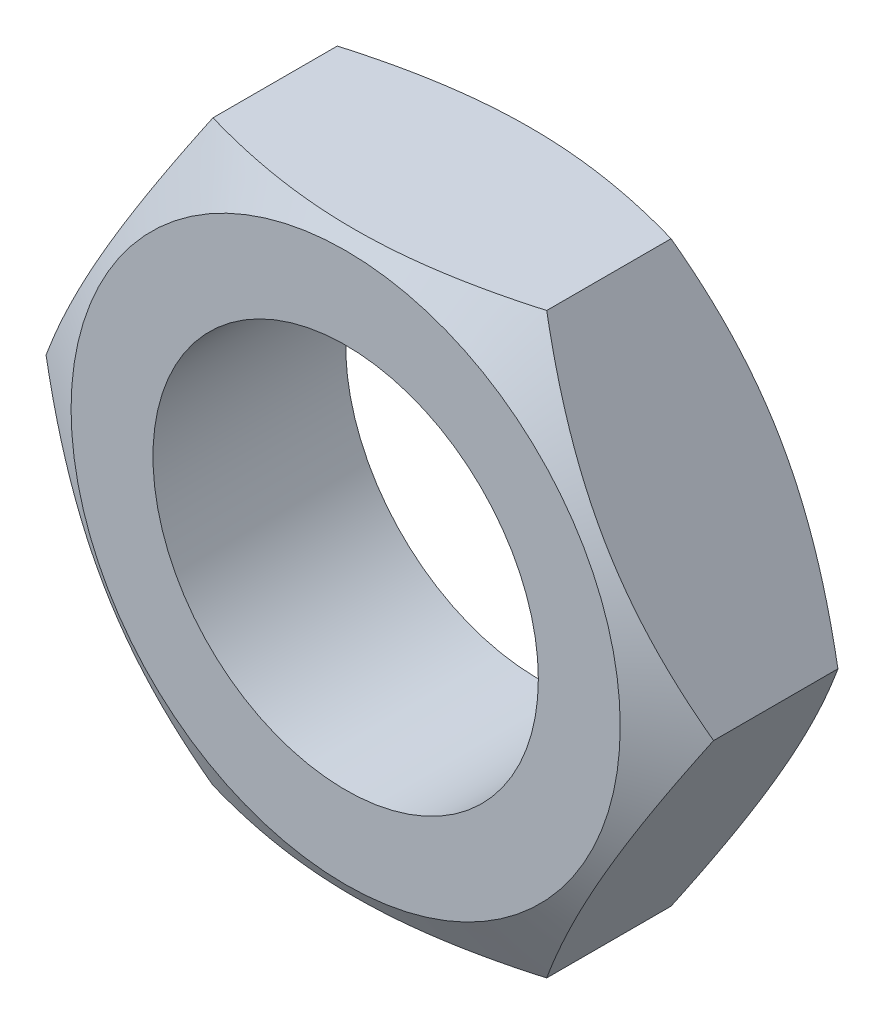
ISO-10303-21;
HEADER;
FILE_DESCRIPTION(('STEP AP214'),'2;1');
FILE_NAME('part.step','',(''),(''),'','','');
FILE_SCHEMA(('AUTOMOTIVE_DESIGN { 1 0 10303 214 1 1 1 1 }'));
ENDSEC;
DATA;
#1=APPLICATION_CONTEXT('core data for automotive mechanical design processes');
#2=APPLICATION_PROTOCOL_DEFINITION('international standard','automotive_design',2000,#1);
#3=PRODUCT_CONTEXT('',#1,'mechanical');
#4=PRODUCT('Part','Part','',(#3));
#5=PRODUCT_RELATED_PRODUCT_CATEGORY('part','',(#4));
#6=PRODUCT_DEFINITION_FORMATION('','',#4);
#7=PRODUCT_DEFINITION_CONTEXT('part definition',#1,'design');
#8=PRODUCT_DEFINITION('design','',#6,#7);
#9=PRODUCT_DEFINITION_SHAPE('','',#8);
#10=(LENGTH_UNIT() NAMED_UNIT(*) SI_UNIT(.MILLI.,.METRE.));
#11=(NAMED_UNIT(*) PLANE_ANGLE_UNIT() SI_UNIT($,.RADIAN.));
#12=(NAMED_UNIT(*) SI_UNIT($,.STERADIAN.) SOLID_ANGLE_UNIT());
#13=UNCERTAINTY_MEASURE_WITH_UNIT(LENGTH_MEASURE(1.E-05),#10,'distance_accuracy_value','');
#14=(GEOMETRIC_REPRESENTATION_CONTEXT(3) GLOBAL_UNCERTAINTY_ASSIGNED_CONTEXT((#13)) GLOBAL_UNIT_ASSIGNED_CONTEXT((#10,
#11,#12)) REPRESENTATION_CONTEXT('',''));
#15=CARTESIAN_POINT('',(0.,0.,0.));
#16=DIRECTION('',(0.,0.,1.));
#17=DIRECTION('',(1.,0.,0.));
#18=AXIS2_PLACEMENT_3D('',#15,#16,#17);
#19=CARTESIAN_POINT('',(13.856406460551,0.,-8.00000000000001));
#20=DIRECTION('',(0.866025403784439,0.5,0.));
#21=DIRECTION('',(-0.5,0.866025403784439,0.));
#22=AXIS2_PLACEMENT_3D('',#19,#20,#21);
#23=PLANE('',#22);
#24=CARTESIAN_POINT('',(13.8565219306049,-0.000200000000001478,-1.41827359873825));
#25=CARTESIAN_POINT('',(13.7042251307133,0.263585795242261,-1.33035979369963));
#26=CARTESIAN_POINT('',(13.5513604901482,0.528355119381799,-1.24643615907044));
#27=CARTESIAN_POINT('',(13.244405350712,1.06001701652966,-1.08767638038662));
#28=CARTESIAN_POINT('',(13.0903144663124,1.32691025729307,-1.01284322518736));
#29=CARTESIAN_POINT('',(12.6255589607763,2.13189040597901,-0.803427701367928));
#30=CARTESIAN_POINT('',(12.3130596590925,2.6731550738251,-0.684313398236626));
#31=CARTESIAN_POINT('',(11.8454187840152,3.483132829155,-0.544641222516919));
#32=CARTESIAN_POINT('',(11.6916742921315,3.74942610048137,-0.504853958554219));
#33=CARTESIAN_POINT('',(11.3834734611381,4.28324559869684,-0.438133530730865));
#34=CARTESIAN_POINT('',(11.2290171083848,4.55077184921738,-0.41120061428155));
#35=CARTESIAN_POINT('',(10.9198468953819,5.08627036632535,-0.3708787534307));
#36=CARTESIAN_POINT('',(10.7651335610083,5.35424172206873,-0.357473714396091));
#37=CARTESIAN_POINT('',(10.4555635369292,5.89043273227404,-0.344493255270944));
#38=CARTESIAN_POINT('',(10.3007068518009,6.15865237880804,-0.344917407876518));
#39=CARTESIAN_POINT('',(10.011202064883,6.66008937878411,-0.358630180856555));
#40=CARTESIAN_POINT('',(9.87653331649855,6.89334249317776,-0.370246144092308));
#41=CARTESIAN_POINT('',(9.60750555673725,7.35931224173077,-0.403718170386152));
#42=CARTESIAN_POINT('',(9.47314656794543,7.59202883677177,-0.425574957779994));
#43=CARTESIAN_POINT('',(9.20481134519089,8.05679907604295,-0.479147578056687));
#44=CARTESIAN_POINT('',(9.07083551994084,8.28885201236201,-0.510871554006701));
#45=CARTESIAN_POINT('',(8.80351197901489,8.75186996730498,-0.583621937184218));
#46=CARTESIAN_POINT('',(8.67016430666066,8.98283491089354,-0.624648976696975));
#47=CARTESIAN_POINT('',(8.2653799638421,9.68394195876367,-0.762721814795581));
#48=CARTESIAN_POINT('',(7.99511549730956,10.1520537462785,-0.873535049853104));
#49=CARTESIAN_POINT('',(7.45861659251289,11.0812971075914,-1.12503592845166));
#50=CARTESIAN_POINT('',(7.19237528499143,11.5424405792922,-1.26566450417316));
#51=CARTESIAN_POINT('',(6.92808776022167,12.0002,-1.41827359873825));
#52=B_SPLINE_CURVE_WITH_KNOTS('',3,(#24,#25,#26,#27,#28,#29,#30,#31,#32,#33,#34,#35,#36,#37,#38,
#39,#40,#41,#42,#43,#44,#45,#46,#47,#48,#49,#50,#51),.UNSPECIFIED.,.F.,.F.,(4,2,2,2,2,2,2,2,2,2,
2,2,2,4),(0.,0.951004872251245,1.90232158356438,3.80900466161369,4.7389455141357,
5.66890426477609,6.59775529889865,7.5265776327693,8.33514643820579,9.1437724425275,
9.95306755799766,10.7624176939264,12.4167102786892,14.0677556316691),.UNSPECIFIED.);
#53=CARTESIAN_POINT('',(13.856406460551,0.,-1.41820693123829));
#54=VERTEX_POINT('',#53);
#55=CARTESIAN_POINT('',(6.92820323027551,12.,-1.41820693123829));
#56=VERTEX_POINT('',#55);
#57=EDGE_CURVE('E67',#54,#56,#52,.T.);
#58=ORIENTED_EDGE('',*,*,#57,.F.);
#59=DIRECTION('',(0.,0.,1.));
#60=VECTOR('',#59,1.);
#61=CARTESIAN_POINT('',(13.856406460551,0.,-8.00000000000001));
#62=LINE('',#61,#60);
#63=CARTESIAN_POINT('',(13.856406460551,0.,-6.58179306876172));
#64=VERTEX_POINT('',#63);
#65=EDGE_CURVE('E14',#64,#54,#62,.T.);
#66=ORIENTED_EDGE('',*,*,#65,.F.);
#67=CARTESIAN_POINT('',(13.8565219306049,-0.000200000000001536,-6.58172640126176));
#68=CARTESIAN_POINT('',(13.7042251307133,0.263585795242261,-6.66964020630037));
#69=CARTESIAN_POINT('',(13.5513604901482,0.528355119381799,-6.75356384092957));
#70=CARTESIAN_POINT('',(13.244405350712,1.06001701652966,-6.91232361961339));
#71=CARTESIAN_POINT('',(13.0903144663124,1.32691025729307,-6.98715677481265));
#72=CARTESIAN_POINT('',(12.6255589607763,2.13189040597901,-7.19657229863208));
#73=CARTESIAN_POINT('',(12.3130596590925,2.6731550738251,-7.31568660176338));
#74=CARTESIAN_POINT('',(11.8454187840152,3.483132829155,-7.45535877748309));
#75=CARTESIAN_POINT('',(11.6916742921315,3.74942610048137,-7.49514604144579));
#76=CARTESIAN_POINT('',(11.3834734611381,4.28324559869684,-7.56186646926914));
#77=CARTESIAN_POINT('',(11.2290171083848,4.55077184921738,-7.58879938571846));
#78=CARTESIAN_POINT('',(10.9198468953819,5.08627036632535,-7.62912124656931));
#79=CARTESIAN_POINT('',(10.7651335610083,5.35424172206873,-7.64252628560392));
#80=CARTESIAN_POINT('',(10.4555635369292,5.89043273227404,-7.65550674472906));
#81=CARTESIAN_POINT('',(10.3007068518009,6.15865237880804,-7.65508259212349));
#82=CARTESIAN_POINT('',(10.011202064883,6.66008937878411,-7.64136981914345));
#83=CARTESIAN_POINT('',(9.87653331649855,6.89334249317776,-7.6297538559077));
#84=CARTESIAN_POINT('',(9.60750555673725,7.35931224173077,-7.59628182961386));
#85=CARTESIAN_POINT('',(9.47314656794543,7.59202883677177,-7.57442504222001));
#86=CARTESIAN_POINT('',(9.20481134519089,8.05679907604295,-7.52085242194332));
#87=CARTESIAN_POINT('',(9.07083551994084,8.28885201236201,-7.48912844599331));
#88=CARTESIAN_POINT('',(8.80351197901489,8.75186996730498,-7.41637806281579));
#89=CARTESIAN_POINT('',(8.67016430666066,8.98283491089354,-7.37535102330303));
#90=CARTESIAN_POINT('',(8.2653799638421,9.68394195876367,-7.23727818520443));
#91=CARTESIAN_POINT('',(7.99511549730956,10.1520537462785,-7.1264649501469));
#92=CARTESIAN_POINT('',(7.45861659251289,11.0812971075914,-6.87496407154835));
#93=CARTESIAN_POINT('',(7.19237528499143,11.5424405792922,-6.73433549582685));
#94=CARTESIAN_POINT('',(6.92808776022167,12.0002,-6.58172640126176));
#95=B_SPLINE_CURVE_WITH_KNOTS('',3,(#67,#68,#69,#70,#71,#72,#73,#74,#75,#76,#77,#78,#79,#80,#81,
#82,#83,#84,#85,#86,#87,#88,#89,#90,#91,#92,#93,#94),.UNSPECIFIED.,.F.,.F.,(4,2,2,2,2,2,2,2,2,2,
2,2,2,4),(0.,0.951004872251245,1.90232158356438,3.80900466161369,4.7389455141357,
5.66890426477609,6.59775529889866,7.5265776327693,8.33514643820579,9.1437724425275,
9.95306755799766,10.7624176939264,12.4167102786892,14.0677556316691),.UNSPECIFIED.);
#96=CARTESIAN_POINT('',(6.92820323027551,12.,-6.58179306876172));
#97=VERTEX_POINT('',#96);
#98=EDGE_CURVE('E136',#64,#97,#95,.T.);
#99=ORIENTED_EDGE('',*,*,#98,.T.);
#100=DIRECTION('',(0.,0.,1.));
#101=VECTOR('',#100,1.);
#102=CARTESIAN_POINT('',(6.92820323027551,12.,-8.00000000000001));
#103=LINE('',#102,#101);
#104=EDGE_CURVE('E54',#97,#56,#103,.T.);
#105=ORIENTED_EDGE('',*,*,#104,.T.);
#106=EDGE_LOOP('',(#58,#66,#99,#105));
#107=FACE_BOUND('',#106,.T.);
#108=ADVANCED_FACE('F50',(#107),#23,.T.);
#109=CARTESIAN_POINT('',(6.92820323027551,-12.,-8.00000000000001));
#110=DIRECTION('',(0.866025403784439,-0.5,0.));
#111=DIRECTION('',(0.5,0.866025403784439,0.));
#112=AXIS2_PLACEMENT_3D('',#109,#110,#111);
#113=PLANE('',#112);
#114=CARTESIAN_POINT('',(6.92808776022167,-12.0002,-1.41827359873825));
#115=CARTESIAN_POINT('',(7.08038456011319,-11.7364142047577,-1.33035979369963));
#116=CARTESIAN_POINT('',(7.23324920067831,-11.4716448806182,-1.24643615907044));
#117=CARTESIAN_POINT('',(7.54020434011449,-10.9399829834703,-1.08767638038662));
#118=CARTESIAN_POINT('',(7.69429522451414,-10.6730897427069,-1.01284322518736));
#119=CARTESIAN_POINT('',(8.15905073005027,-9.86810959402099,-0.803427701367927));
#120=CARTESIAN_POINT('',(8.47155003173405,-9.3268449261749,-0.684313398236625));
#121=CARTESIAN_POINT('',(8.93919090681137,-8.516867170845,-0.544641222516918));
#122=CARTESIAN_POINT('',(9.09293539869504,-8.25057389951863,-0.504853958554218));
#123=CARTESIAN_POINT('',(9.40113622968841,-7.71675440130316,-0.438133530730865));
#124=CARTESIAN_POINT('',(9.55559258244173,-7.44922815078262,-0.41120061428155));
#125=CARTESIAN_POINT('',(9.86476279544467,-6.91372963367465,-0.3708787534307));
#126=CARTESIAN_POINT('',(10.0194761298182,-6.64575827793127,-0.357473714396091));
#127=CARTESIAN_POINT('',(10.3290461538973,-6.10956726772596,-0.344493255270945));
#128=CARTESIAN_POINT('',(10.4839028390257,-5.84134762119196,-0.344917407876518));
#129=CARTESIAN_POINT('',(10.7734076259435,-5.33991062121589,-0.358630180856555));
#130=CARTESIAN_POINT('',(10.908076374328,-5.10665750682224,-0.370246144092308));
#131=CARTESIAN_POINT('',(11.1771041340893,-4.64068775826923,-0.403718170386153));
#132=CARTESIAN_POINT('',(11.3114631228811,-4.40797116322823,-0.425574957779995));
#133=CARTESIAN_POINT('',(11.5797983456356,-3.94320092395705,-0.479147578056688));
#134=CARTESIAN_POINT('',(11.7137741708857,-3.711147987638,-0.5108715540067));
#135=CARTESIAN_POINT('',(11.9810977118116,-3.24813003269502,-0.583621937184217));
#136=CARTESIAN_POINT('',(12.1144453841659,-3.01716508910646,-0.624648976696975));
#137=CARTESIAN_POINT('',(12.5192297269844,-2.31605804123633,-0.762721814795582));
#138=CARTESIAN_POINT('',(12.789494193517,-1.84794625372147,-0.873535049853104));
#139=CARTESIAN_POINT('',(13.3259930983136,-0.918702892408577,-1.12503592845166));
#140=CARTESIAN_POINT('',(13.5922344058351,-0.457559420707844,-1.26566450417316));
#141=CARTESIAN_POINT('',(13.8565219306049,0.000199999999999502,-1.41827359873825));
#142=B_SPLINE_CURVE_WITH_KNOTS('',3,(#114,#115,#116,#117,#118,#119,#120,#121,#122,#123,#124,
#125,#126,#127,#128,#129,#130,#131,#132,#133,#134,#135,#136,#137,#138,#139,#140,#141),
.UNSPECIFIED.,.F.,.F.,(4,2,2,2,2,2,2,2,2,2,2,2,2,4),(0.,0.951004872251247,1.90232158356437,
3.80900466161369,4.7389455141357,5.66890426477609,6.59775529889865,7.5265776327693,
8.33514643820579,9.14377244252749,9.95306755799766,10.7624176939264,12.4167102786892,
14.0677556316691),.UNSPECIFIED.);
#143=CARTESIAN_POINT('',(6.92820323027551,-12.,-1.41820693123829));
#144=VERTEX_POINT('',#143);
#145=EDGE_CURVE('E203',#144,#54,#142,.T.);
#146=ORIENTED_EDGE('',*,*,#145,.F.);
#147=DIRECTION('',(0.,0.,1.));
#148=VECTOR('',#147,1.);
#149=CARTESIAN_POINT('',(6.92820323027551,-12.,-8.00000000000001));
#150=LINE('',#149,#148);
#151=CARTESIAN_POINT('',(6.92820323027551,-12.,-6.58179306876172));
#152=VERTEX_POINT('',#151);
#153=EDGE_CURVE('E59',#152,#144,#150,.T.);
#154=ORIENTED_EDGE('',*,*,#153,.F.);
#155=CARTESIAN_POINT('',(6.92808776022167,-12.0002,-6.58172640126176));
#156=CARTESIAN_POINT('',(7.08038456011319,-11.7364142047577,-6.66964020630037));
#157=CARTESIAN_POINT('',(7.23324920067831,-11.4716448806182,-6.75356384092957));
#158=CARTESIAN_POINT('',(7.54020434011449,-10.9399829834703,-6.91232361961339));
#159=CARTESIAN_POINT('',(7.69429522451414,-10.6730897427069,-6.98715677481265));
#160=CARTESIAN_POINT('',(8.15905073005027,-9.86810959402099,-7.19657229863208));
#161=CARTESIAN_POINT('',(8.47155003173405,-9.3268449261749,-7.31568660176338));
#162=CARTESIAN_POINT('',(8.93919090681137,-8.516867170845,-7.45535877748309));
#163=CARTESIAN_POINT('',(9.09293539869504,-8.25057389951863,-7.49514604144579));
#164=CARTESIAN_POINT('',(9.40113622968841,-7.71675440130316,-7.56186646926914));
#165=CARTESIAN_POINT('',(9.55559258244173,-7.44922815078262,-7.58879938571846));
#166=CARTESIAN_POINT('',(9.86476279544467,-6.91372963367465,-7.62912124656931));
#167=CARTESIAN_POINT('',(10.0194761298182,-6.64575827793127,-7.64252628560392));
#168=CARTESIAN_POINT('',(10.3290461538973,-6.10956726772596,-7.65550674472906));
#169=CARTESIAN_POINT('',(10.4839028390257,-5.84134762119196,-7.65508259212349));
#170=CARTESIAN_POINT('',(10.7734076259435,-5.33991062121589,-7.64136981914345));
#171=CARTESIAN_POINT('',(10.908076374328,-5.10665750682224,-7.6297538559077));
#172=CARTESIAN_POINT('',(11.1771041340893,-4.64068775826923,-7.59628182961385));
#173=CARTESIAN_POINT('',(11.3114631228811,-4.40797116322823,-7.57442504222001));
#174=CARTESIAN_POINT('',(11.5797983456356,-3.94320092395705,-7.52085242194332));
#175=CARTESIAN_POINT('',(11.7137741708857,-3.711147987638,-7.48912844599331));
#176=CARTESIAN_POINT('',(11.9810977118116,-3.24813003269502,-7.41637806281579));
#177=CARTESIAN_POINT('',(12.1144453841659,-3.01716508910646,-7.37535102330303));
#178=CARTESIAN_POINT('',(12.5192297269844,-2.31605804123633,-7.23727818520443));
#179=CARTESIAN_POINT('',(12.789494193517,-1.84794625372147,-7.1264649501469));
#180=CARTESIAN_POINT('',(13.3259930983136,-0.918702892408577,-6.87496407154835));
#181=CARTESIAN_POINT('',(13.5922344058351,-0.457559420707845,-6.73433549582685));
#182=CARTESIAN_POINT('',(13.8565219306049,0.000199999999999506,-6.58172640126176));
#183=B_SPLINE_CURVE_WITH_KNOTS('',3,(#155,#156,#157,#158,#159,#160,#161,#162,#163,#164,#165,
#166,#167,#168,#169,#170,#171,#172,#173,#174,#175,#176,#177,#178,#179,#180,#181,#182),
.UNSPECIFIED.,.F.,.F.,(4,2,2,2,2,2,2,2,2,2,2,2,2,4),(0.,0.951004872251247,1.90232158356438,
3.80900466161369,4.7389455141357,5.66890426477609,6.59775529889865,7.5265776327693,
8.33514643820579,9.14377244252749,9.95306755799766,10.7624176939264,12.4167102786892,
14.0677556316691),.UNSPECIFIED.);
#184=EDGE_CURVE('E145',#152,#64,#183,.T.);
#185=ORIENTED_EDGE('',*,*,#184,.T.);
#186=ORIENTED_EDGE('',*,*,#65,.T.);
#187=EDGE_LOOP('',(#146,#154,#185,#186));
#188=FACE_BOUND('',#187,.T.);
#189=ADVANCED_FACE('F189',(#188),#113,.T.);
#190=CARTESIAN_POINT('',(6.92820323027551,-12.,-8.00000000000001));
#191=DIRECTION('',(0.,1.,0.));
#192=DIRECTION('',(0.,0.,1.));
#193=AXIS2_PLACEMENT_3D('',#190,#191,#192);
#194=PLANE('',#193);
#195=ORIENTED_EDGE('',*,*,#153,.T.);
#196=CARTESIAN_POINT('',(-18.6621890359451,-12.,-6.22806380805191));
#197=CARTESIAN_POINT('',(-18.3998727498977,-12.,-6.10068014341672));
#198=CARTESIAN_POINT('',(-18.1372500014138,-12.,-5.97392786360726));
#199=CARTESIAN_POINT('',(-17.6113276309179,-12.,-5.72182899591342));
#200=CARTESIAN_POINT('',(-17.3480280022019,-12.,-5.59648242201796));
#201=CARTESIAN_POINT('',(-16.5569484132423,-12.,-5.22273291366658));
#202=CARTESIAN_POINT('',(-16.0280646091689,-12.,-4.97665761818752));
#203=CARTESIAN_POINT('',(-14.9639220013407,-12.,-4.49087958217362));
#204=CARTESIAN_POINT('',(-14.4286442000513,-12.,-4.25121835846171));
#205=CARTESIAN_POINT('',(-13.353848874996,-12.,-3.78163326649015));
#206=CARTESIAN_POINT('',(-12.8143315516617,-12.,-3.55170894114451));
#207=CARTESIAN_POINT('',(-11.7127768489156,-12.,-3.09698134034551));
#208=CARTESIAN_POINT('',(-11.1505727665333,-12.,-2.87257980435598));
#209=CARTESIAN_POINT('',(-10.0196031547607,-12.,-2.44063346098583));
#210=CARTESIAN_POINT('',(-9.450836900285,-12.,-2.23309053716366));
#211=CARTESIAN_POINT('',(-8.30690331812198,-12.,-1.84027333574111));
#212=CARTESIAN_POINT('',(-7.73175142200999,-12.,-1.65495447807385));
#213=CARTESIAN_POINT('',(-6.57314432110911,-12.,-1.31248582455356));
#214=CARTESIAN_POINT('',(-5.98969177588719,-12.,-1.15532721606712));
#215=CARTESIAN_POINT('',(-5.10974707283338,-12.,-0.946787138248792));
#216=CARTESIAN_POINT('',(-4.8164262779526,-12.,-0.881943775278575));
#217=CARTESIAN_POINT('',(-4.22777074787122,-12.,-0.762097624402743));
#218=CARTESIAN_POINT('',(-3.93243605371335,-12.,-0.707094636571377));
#219=CARTESIAN_POINT('',(-3.33995366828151,-12.,-0.607897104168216));
#220=CARTESIAN_POINT('',(-3.04280601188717,-12.,-0.56370235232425));
#221=CARTESIAN_POINT('',(-2.4470072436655,-12.,-0.487000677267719));
#222=CARTESIAN_POINT('',(-2.14835619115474,-12.,-0.454493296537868));
#223=CARTESIAN_POINT('',(-1.5538927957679,-12.,-0.402222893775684));
#224=CARTESIAN_POINT('',(-1.25809478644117,-12.,-0.382297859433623));
#225=CARTESIAN_POINT('',(-0.66592171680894,-12.,-0.35497736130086));
#226=CARTESIAN_POINT('',(-0.369546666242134,-12.,-0.347581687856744));
#227=CARTESIAN_POINT('',(0.223253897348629,-12.,-0.345496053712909));
#228=CARTESIAN_POINT('',(0.519679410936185,-12.,-0.350806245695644));
#229=CARTESIAN_POINT('',(1.11204134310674,-12.,-0.374002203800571));
#230=CARTESIAN_POINT('',(1.40797773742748,-12.,-0.391888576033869));
#231=CARTESIAN_POINT('',(2.1174605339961,-12.,-0.449465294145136));
#232=CARTESIAN_POINT('',(2.53054076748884,-12.,-0.495025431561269));
#233=CARTESIAN_POINT('',(3.35365157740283,-12.,-0.608176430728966));
#234=CARTESIAN_POINT('',(3.7636817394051,-12.,-0.675770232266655));
#235=CARTESIAN_POINT('',(4.98870520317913,-12.,-0.908018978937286));
#236=CARTESIAN_POINT('',(5.79819417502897,-12.,-1.10210106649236));
#237=CARTESIAN_POINT('',(7.00899483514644,-12.,-1.43894947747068));
#238=CARTESIAN_POINT('',(7.4165737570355,-12.,-1.56048477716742));
#239=CARTESIAN_POINT('',(8.22777173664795,-12.,-1.8162388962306));
#240=CARTESIAN_POINT('',(8.63139076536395,-12.,-1.95045780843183));
#241=CARTESIAN_POINT('',(9.43479944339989,-12.,-2.22942003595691));
#242=CARTESIAN_POINT('',(9.83459025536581,-12.,-2.37416003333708));
#243=CARTESIAN_POINT('',(10.6308505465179,-12.,-2.67245488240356));
#244=CARTESIAN_POINT('',(11.0273200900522,-12.,-2.82600956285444));
#245=CARTESIAN_POINT('',(12.0605293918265,-12.,-3.23727227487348));
#246=CARTESIAN_POINT('',(12.694910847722,-12.,-3.50089824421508));
#247=CARTESIAN_POINT('',(13.9574933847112,-12.,-4.04260499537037));
#248=CARTESIAN_POINT('',(14.5856938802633,-12.,-4.32068713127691));
#249=CARTESIAN_POINT('',(15.8372708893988,-12.,-4.88800709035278));
#250=CARTESIAN_POINT('',(16.4606457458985,-12.,-5.17724855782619));
#251=CARTESIAN_POINT('',(17.7033003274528,-12.,-5.76431835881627));
#252=CARTESIAN_POINT('',(18.322580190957,-12.,-6.06214640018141));
#253=CARTESIAN_POINT('',(19.5587115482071,-12.,-6.6650139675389));
#254=CARTESIAN_POINT('',(20.1755582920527,-12.,-6.97006321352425));
#255=CARTESIAN_POINT('',(21.4065334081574,-12.,-7.58559997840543));
#256=CARTESIAN_POINT('',(22.0206617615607,-12.,-7.89608753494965));
#257=CARTESIAN_POINT('',(23.2465557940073,-12.,-8.52140690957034));
#258=CARTESIAN_POINT('',(23.8583218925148,-12.,-8.83623790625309));
#259=CARTESIAN_POINT('',(25.0799779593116,-12.,-9.46951125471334));
#260=CARTESIAN_POINT('',(25.6898679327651,-12.,-9.78795359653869));
#261=CARTESIAN_POINT('',(27.3955756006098,-12.,-10.6838713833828));
#262=CARTESIAN_POINT('',(28.4896395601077,-12.,-11.2646851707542));
#263=CARTESIAN_POINT('',(30.6740549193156,-12.,-12.4333742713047));
#264=CARTESIAN_POINT('',(31.7644061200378,-12.,-13.0212499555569));
#265=CARTESIAN_POINT('',(33.9389193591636,-12.,-14.2005035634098));
#266=CARTESIAN_POINT('',(35.0230901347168,-12.,-14.7918653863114));
#267=CARTESIAN_POINT('',(36.6476384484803,-12.,-15.6819323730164));
#268=CARTESIAN_POINT('',(37.1888512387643,-12.,-15.9791150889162));
#269=CARTESIAN_POINT('',(38.2707786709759,-12.,-16.5743843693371));
#270=CARTESIAN_POINT('',(38.8114933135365,-12.,-16.8724709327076));
#271=CARTESIAN_POINT('',(39.3519888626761,-12.,-17.1709543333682));
#272=B_SPLINE_CURVE_WITH_KNOTS('',3,(#196,#197,#198,#199,#200,#201,#202,#203,#204,#205,#206,
#207,#208,#209,#210,#211,#212,#213,#214,#215,#216,#217,#218,#219,#220,#221,#222,#223,#224,#225,
#226,#227,#228,#229,#230,#231,#232,#233,#234,#235,#236,#237,#238,#239,#240,#241,#242,#243,#244,
#245,#246,#247,#248,#249,#250,#251,#252,#253,#254,#255,#256,#257,#258,#259,#260,#261,#262,#263,
#264,#265,#266,#267,#268,#269,#270,#271),.UNSPECIFIED.,.F.,.F.,(4,2,2,2,2,2,2,2,2,2,2,2,2,2,2,2,
2,2,2,2,2,2,2,2,2,2,2,2,2,2,2,2,2,2,2,2,2,4),(0.,0.874828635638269,1.74966596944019,
3.49959708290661,5.25896415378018,7.01824854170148,8.83404465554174,10.6500433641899,
12.4623361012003,14.2740606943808,15.1751302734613,16.0761815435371,16.9772155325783,
17.8782142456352,18.7673613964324,19.6564936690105,20.5456366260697,21.4348224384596,
22.6808753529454,23.9270945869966,26.4208445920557,27.6966767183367,28.9725181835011,
30.2479590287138,31.5233751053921,33.5840464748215,35.6449112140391,37.7064547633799,
39.7679282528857,41.8323550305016,43.8967961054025,45.9608519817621,48.0249021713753,
51.7408929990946,55.4570799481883,59.1619586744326,61.0142700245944,62.8665790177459),.UNSPECIFIED.);
#273=CARTESIAN_POINT('',(-6.92820323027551,-12.,-1.41820693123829));
#274=VERTEX_POINT('',#273);
#275=EDGE_CURVE('E196',#144,#274,#272,.F.);
#276=ORIENTED_EDGE('',*,*,#275,.T.);
#277=DIRECTION('',(0.,0.,1.));
#278=VECTOR('',#277,1.);
#279=CARTESIAN_POINT('',(-6.92820323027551,-12.,-8.00000000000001));
#280=LINE('',#279,#278);
#281=CARTESIAN_POINT('',(-6.92820323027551,-12.,-6.58179306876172));
#282=VERTEX_POINT('',#281);
#283=EDGE_CURVE('E125',#282,#274,#280,.T.);
#284=ORIENTED_EDGE('',*,*,#283,.F.);
#285=CARTESIAN_POINT('',(-18.6864834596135,-12.,-1.76013607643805));
#286=CARTESIAN_POINT('',(-18.4240642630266,-12.,-1.88761818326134));
#287=CARTESIAN_POINT('',(-18.1613391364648,-12.,-2.01447024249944));
#288=CARTESIAN_POINT('',(-17.6352131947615,-12.,-2.2667716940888));
#289=CARTESIAN_POINT('',(-17.3718123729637,-12.,-2.39222107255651));
#290=CARTESIAN_POINT('',(-16.5804314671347,-12.,-2.7662839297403));
#291=CARTESIAN_POINT('',(-16.0513494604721,-12.,-3.01257485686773));
#292=CARTESIAN_POINT('',(-14.9868276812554,-12.,-3.49879698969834));
#293=CARTESIAN_POINT('',(-14.451369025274,-12.,-3.73868695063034));
#294=CARTESIAN_POINT('',(-13.3762190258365,-12.,-4.20875237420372));
#295=CARTESIAN_POINT('',(-12.8365278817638,-12.,-4.43892829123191));
#296=CARTESIAN_POINT('',(-11.734533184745,-12.,-4.89423606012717));
#297=CARTESIAN_POINT('',(-11.172062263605,-12.,-5.11896491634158));
#298=CARTESIAN_POINT('',(-10.0405648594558,-12.,-5.55159956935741));
#299=CARTESIAN_POINT('',(-9.47153765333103,-12.,-5.75950348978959));
#300=CARTESIAN_POINT('',(-8.32708033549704,-12.,-6.15308459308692));
#301=CARTESIAN_POINT('',(-7.75166557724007,-12.,-6.33880606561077));
#302=CARTESIAN_POINT('',(-6.59252918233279,-12.,-6.68212515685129));
#303=CARTESIAN_POINT('',(-6.00881019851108,-12.,-6.8397315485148));
#304=CARTESIAN_POINT('',(-5.12846360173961,-12.,-7.04897140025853));
#305=CARTESIAN_POINT('',(-4.83501305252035,-12.,-7.11405129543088));
#306=CARTESIAN_POINT('',(-4.24609267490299,-12.,-7.23437952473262));
#307=CARTESIAN_POINT('',(-3.95062288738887,-12.,-7.28962805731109));
#308=CARTESIAN_POINT('',(-3.35786336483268,-12.,-7.3893228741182));
#309=CARTESIAN_POINT('',(-3.06057366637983,-12.,-7.43376937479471));
#310=CARTESIAN_POINT('',(-2.46448192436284,-12.,-7.51097668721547));
#311=CARTESIAN_POINT('',(-2.16567994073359,-12.,-7.54373795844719));
#312=CARTESIAN_POINT('',(-1.57091850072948,-12.,-7.59650867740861));
#313=CARTESIAN_POINT('',(-1.27497355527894,-12.,-7.61668066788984));
#314=CARTESIAN_POINT('',(-0.682496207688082,-12.,-7.64448736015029));
#315=CARTESIAN_POINT('',(-0.385963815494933,-12.,-7.65212227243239));
#316=CARTESIAN_POINT('',(0.207161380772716,-12.,-7.65467286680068));
#317=CARTESIAN_POINT('',(0.503754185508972,-12.,-7.64958840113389));
#318=CARTESIAN_POINT('',(1.09645941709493,-12.,-7.62682519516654));
#319=CARTESIAN_POINT('',(1.3925718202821,-12.,-7.60914585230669));
#320=CARTESIAN_POINT('',(2.10174795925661,-12.,-7.55209835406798));
#321=CARTESIAN_POINT('',(2.51435217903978,-12.,-7.50689209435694));
#322=CARTESIAN_POINT('',(3.33653036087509,-12.,-7.39447324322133));
#323=CARTESIAN_POINT('',(3.74610391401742,-12.,-7.32725773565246));
#324=CARTESIAN_POINT('',(4.96977811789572,-12.,-7.09615911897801));
#325=CARTESIAN_POINT('',(5.77839925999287,-12.,-6.90286339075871));
#326=CARTESIAN_POINT('',(6.98793437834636,-12.,-6.56717696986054));
#327=CARTESIAN_POINT('',(7.39510372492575,-12.,-6.4460264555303));
#328=CARTESIAN_POINT('',(8.20548701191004,-12.,-6.19103119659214));
#329=CARTESIAN_POINT('',(8.60870092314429,-12.,-6.05718635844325));
#330=CARTESIAN_POINT('',(9.41130283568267,-12.,-5.77895973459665));
#331=CARTESIAN_POINT('',(9.81069198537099,-12.,-5.63458123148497));
#332=CARTESIAN_POINT('',(10.6061488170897,-12.,-5.33699761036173));
#333=CARTESIAN_POINT('',(11.0022165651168,-12.,-5.18379266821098));
#334=CARTESIAN_POINT('',(12.0397464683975,-12.,-4.7712952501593));
#335=CARTESIAN_POINT('',(12.678785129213,-12.,-4.50591389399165));
#336=CARTESIAN_POINT('',(13.9505851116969,-12.,-3.96046341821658));
#337=CARTESIAN_POINT('',(14.5833458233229,-12.,-3.68039288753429));
#338=CARTESIAN_POINT('',(15.8439780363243,-12.,-3.10893693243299));
#339=CARTESIAN_POINT('',(16.4718478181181,-12.,-2.81754772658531));
#340=CARTESIAN_POINT('',(17.7234397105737,-12.,-2.22607649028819));
#341=CARTESIAN_POINT('',(18.3471619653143,-12.,-1.92599476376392));
#342=CARTESIAN_POINT('',(19.592162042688,-12.,-1.31853592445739));
#343=CARTESIAN_POINT('',(20.2134349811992,-12.,-1.01114882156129));
#344=CARTESIAN_POINT('',(21.4532353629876,-12.,-0.390884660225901));
#345=CARTESIAN_POINT('',(22.0717627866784,-12.,-0.0780075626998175));
#346=CARTESIAN_POINT('',(23.306431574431,-12.,0.552125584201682));
#347=CARTESIAN_POINT('',(23.9225733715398,-12.,0.869380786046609));
#348=CARTESIAN_POINT('',(25.1529661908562,-12.,1.5075286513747));
#349=CARTESIAN_POINT('',(25.7672172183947,-12.,1.82842130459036));
#350=CARTESIAN_POINT('',(27.4839862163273,-12.,2.73062987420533));
#351=CARTESIAN_POINT('',(28.5847437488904,-12.,3.31529508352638));
#352=CARTESIAN_POINT('',(30.782534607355,-12.,4.49170952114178));
#353=CARTESIAN_POINT('',(31.8795677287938,-12.,5.08345913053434));
#354=CARTESIAN_POINT('',(34.0673709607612,-12.,6.27043540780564));
#355=CARTESIAN_POINT('',(35.1581499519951,-12.,6.86564571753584));
#356=CARTESIAN_POINT('',(36.7926067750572,-12.,7.76148909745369));
#357=CARTESIAN_POINT('',(37.3371213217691,-12.,8.06059763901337));
#358=CARTESIAN_POINT('',(38.4256515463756,-12.,8.65971954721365));
#359=CARTESIAN_POINT('',(38.9696672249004,-12.,8.95973291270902));
#360=CARTESIAN_POINT('',(39.5134635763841,-12.,9.26014340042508));
#361=B_SPLINE_CURVE_WITH_KNOTS('',3,(#285,#286,#287,#288,#289,#290,#291,#292,#293,#294,#295,
#296,#297,#298,#299,#300,#301,#302,#303,#304,#305,#306,#307,#308,#309,#310,#311,#312,#313,#314,
#315,#316,#317,#318,#319,#320,#321,#322,#323,#324,#325,#326,#327,#328,#329,#330,#331,#332,#333,
#334,#335,#336,#337,#338,#339,#340,#341,#342,#343,#344,#345,#346,#347,#348,#349,#350,#351,#352,
#353,#354,#355,#356,#357,#358,#359,#360),.UNSPECIFIED.,.F.,.F.,(4,2,2,2,2,2,2,2,2,2,2,2,2,2,2,2,
2,2,2,2,2,2,2,2,2,2,2,2,2,2,2,2,2,2,2,2,2,4),(0.,0.875235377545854,1.75047941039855,
3.50122280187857,5.26136589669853,7.02142656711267,8.83833119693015,10.6554381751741,
12.468854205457,14.281703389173,15.1833067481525,16.0848919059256,16.9864589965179,
17.8879906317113,18.7776275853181,19.6672496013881,20.5568819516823,21.4465568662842,
22.6910756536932,23.9357594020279,26.4264255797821,27.7007499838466,28.9750837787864,
30.2490221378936,31.5229351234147,33.5985217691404,35.6743081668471,37.7507941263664,
39.8272075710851,41.9066456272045,43.9860984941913,46.0651543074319,48.1442042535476,
51.883349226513,55.6226962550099,59.3505076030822,61.2142822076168,63.078054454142),.UNSPECIFIED.);
#362=EDGE_CURVE('E180',#152,#282,#361,.F.);
#363=ORIENTED_EDGE('',*,*,#362,.F.);
#364=EDGE_LOOP('',(#195,#276,#284,#363));
#365=FACE_BOUND('',#364,.T.);
#366=ADVANCED_FACE('F185',(#365),#194,.F.);
#367=CARTESIAN_POINT('',(-13.856406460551,0.,-8.00000000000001));
#368=DIRECTION('',(-0.866025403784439,-0.5,0.));
#369=DIRECTION('',(0.5,-0.866025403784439,0.));
#370=AXIS2_PLACEMENT_3D('',#367,#368,#369);
#371=PLANE('',#370);
#372=CARTESIAN_POINT('',(-13.8565219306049,0.000199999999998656,-1.41827359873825));
#373=CARTESIAN_POINT('',(-13.7042251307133,-0.263585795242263,-1.33035979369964));
#374=CARTESIAN_POINT('',(-13.5513604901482,-0.528355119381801,-1.24643615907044));
#375=CARTESIAN_POINT('',(-13.244405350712,-1.06001701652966,-1.08767638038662));
#376=CARTESIAN_POINT('',(-13.0903144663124,-1.32691025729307,-1.01284322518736));
#377=CARTESIAN_POINT('',(-12.6255589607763,-2.13189040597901,-0.803427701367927));
#378=CARTESIAN_POINT('',(-12.3130596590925,-2.6731550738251,-0.684313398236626));
#379=CARTESIAN_POINT('',(-11.8454187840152,-3.483132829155,-0.54464122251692));
#380=CARTESIAN_POINT('',(-11.6916742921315,-3.74942610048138,-0.50485395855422));
#381=CARTESIAN_POINT('',(-11.3834734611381,-4.28324559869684,-0.438133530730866));
#382=CARTESIAN_POINT('',(-11.2290171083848,-4.55077184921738,-0.41120061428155));
#383=CARTESIAN_POINT('',(-10.9198468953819,-5.08627036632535,-0.3708787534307));
#384=CARTESIAN_POINT('',(-10.7651335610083,-5.35424172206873,-0.357473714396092));
#385=CARTESIAN_POINT('',(-10.4555635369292,-5.89043273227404,-0.344493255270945));
#386=CARTESIAN_POINT('',(-10.3007068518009,-6.15865237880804,-0.344917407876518));
#387=CARTESIAN_POINT('',(-10.011202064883,-6.66008937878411,-0.358630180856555));
#388=CARTESIAN_POINT('',(-9.87653331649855,-6.89334249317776,-0.370246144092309));
#389=CARTESIAN_POINT('',(-9.60750555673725,-7.35931224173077,-0.403718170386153));
#390=CARTESIAN_POINT('',(-9.47314656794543,-7.59202883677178,-0.425574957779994));
#391=CARTESIAN_POINT('',(-9.2048113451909,-8.05679907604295,-0.479147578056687));
#392=CARTESIAN_POINT('',(-9.07083551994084,-8.28885201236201,-0.510871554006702));
#393=CARTESIAN_POINT('',(-8.80351197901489,-8.75186996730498,-0.583621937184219));
#394=CARTESIAN_POINT('',(-8.67016430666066,-8.98283491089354,-0.624648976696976));
#395=CARTESIAN_POINT('',(-8.2653799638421,-9.68394195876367,-0.762721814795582));
#396=CARTESIAN_POINT('',(-7.99511549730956,-10.1520537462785,-0.873535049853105));
#397=CARTESIAN_POINT('',(-7.45861659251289,-11.0812971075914,-1.12503592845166));
#398=CARTESIAN_POINT('',(-7.19237528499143,-11.5424405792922,-1.26566450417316));
#399=CARTESIAN_POINT('',(-6.92808776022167,-12.0002,-1.41827359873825));
#400=B_SPLINE_CURVE_WITH_KNOTS('',3,(#372,#373,#374,#375,#376,#377,#378,#379,#380,#381,#382,
#383,#384,#385,#386,#387,#388,#389,#390,#391,#392,#393,#394,#395,#396,#397,#398,#399),
.UNSPECIFIED.,.F.,.F.,(4,2,2,2,2,2,2,2,2,2,2,2,2,4),(0.,0.951004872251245,1.90232158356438,
3.80900466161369,4.7389455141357,5.66890426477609,6.59775529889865,7.5265776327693,
8.33514643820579,9.14377244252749,9.95306755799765,10.7624176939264,12.4167102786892,
14.0677556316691),.UNSPECIFIED.);
#401=CARTESIAN_POINT('',(-13.856406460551,0.,-1.41820693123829));
#402=VERTEX_POINT('',#401);
#403=EDGE_CURVE('E121',#402,#274,#400,.T.);
#404=ORIENTED_EDGE('',*,*,#403,.F.);
#405=DIRECTION('',(0.,0.,1.));
#406=VECTOR('',#405,1.);
#407=CARTESIAN_POINT('',(-13.856406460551,0.,-8.00000000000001));
#408=LINE('',#407,#406);
#409=CARTESIAN_POINT('',(-13.856406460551,0.,-6.58179306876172));
#410=VERTEX_POINT('',#409);
#411=EDGE_CURVE('E120',#410,#402,#408,.T.);
#412=ORIENTED_EDGE('',*,*,#411,.F.);
#413=CARTESIAN_POINT('',(-13.8565219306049,0.000199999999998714,-6.58172640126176));
#414=CARTESIAN_POINT('',(-13.7042251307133,-0.263585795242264,-6.66964020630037));
#415=CARTESIAN_POINT('',(-13.5513604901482,-0.528355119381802,-6.75356384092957));
#416=CARTESIAN_POINT('',(-13.244405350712,-1.06001701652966,-6.91232361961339));
#417=CARTESIAN_POINT('',(-13.0903144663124,-1.32691025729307,-6.98715677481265));
#418=CARTESIAN_POINT('',(-12.6255589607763,-2.13189040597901,-7.19657229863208));
#419=CARTESIAN_POINT('',(-12.3130596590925,-2.6731550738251,-7.31568660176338));
#420=CARTESIAN_POINT('',(-11.8454187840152,-3.483132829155,-7.45535877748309));
#421=CARTESIAN_POINT('',(-11.6916742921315,-3.74942610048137,-7.49514604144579));
#422=CARTESIAN_POINT('',(-11.3834734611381,-4.28324559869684,-7.56186646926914));
#423=CARTESIAN_POINT('',(-11.2290171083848,-4.55077184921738,-7.58879938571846));
#424=CARTESIAN_POINT('',(-10.9198468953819,-5.08627036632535,-7.62912124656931));
#425=CARTESIAN_POINT('',(-10.7651335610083,-5.35424172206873,-7.64252628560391));
#426=CARTESIAN_POINT('',(-10.4555635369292,-5.89043273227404,-7.65550674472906));
#427=CARTESIAN_POINT('',(-10.3007068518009,-6.15865237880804,-7.65508259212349));
#428=CARTESIAN_POINT('',(-10.011202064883,-6.66008937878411,-7.64136981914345));
#429=CARTESIAN_POINT('',(-9.87653331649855,-6.89334249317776,-7.6297538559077));
#430=CARTESIAN_POINT('',(-9.60750555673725,-7.35931224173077,-7.59628182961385));
#431=CARTESIAN_POINT('',(-9.47314656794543,-7.59202883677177,-7.57442504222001));
#432=CARTESIAN_POINT('',(-9.2048113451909,-8.05679907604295,-7.52085242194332));
#433=CARTESIAN_POINT('',(-9.07083551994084,-8.28885201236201,-7.48912844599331));
#434=CARTESIAN_POINT('',(-8.80351197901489,-8.75186996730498,-7.41637806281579));
#435=CARTESIAN_POINT('',(-8.67016430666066,-8.98283491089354,-7.37535102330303));
#436=CARTESIAN_POINT('',(-8.2653799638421,-9.68394195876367,-7.23727818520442));
#437=CARTESIAN_POINT('',(-7.99511549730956,-10.1520537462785,-7.1264649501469));
#438=CARTESIAN_POINT('',(-7.45861659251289,-11.0812971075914,-6.87496407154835));
#439=CARTESIAN_POINT('',(-7.19237528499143,-11.5424405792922,-6.73433549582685));
#440=CARTESIAN_POINT('',(-6.92808776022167,-12.0002,-6.58172640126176));
#441=B_SPLINE_CURVE_WITH_KNOTS('',3,(#413,#414,#415,#416,#417,#418,#419,#420,#421,#422,#423,
#424,#425,#426,#427,#428,#429,#430,#431,#432,#433,#434,#435,#436,#437,#438,#439,#440),
.UNSPECIFIED.,.F.,.F.,(4,2,2,2,2,2,2,2,2,2,2,2,2,4),(0.,0.951004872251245,1.90232158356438,
3.80900466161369,4.7389455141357,5.66890426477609,6.59775529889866,7.5265776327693,
8.33514643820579,9.14377244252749,9.95306755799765,10.7624176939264,12.4167102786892,
14.0677556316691),.UNSPECIFIED.);
#442=EDGE_CURVE('E175',#410,#282,#441,.T.);
#443=ORIENTED_EDGE('',*,*,#442,.T.);
#444=ORIENTED_EDGE('',*,*,#283,.T.);
#445=EDGE_LOOP('',(#404,#412,#443,#444));
#446=FACE_BOUND('',#445,.T.);
#447=ADVANCED_FACE('F188',(#446),#371,.T.);
#448=CARTESIAN_POINT('',(-6.92820323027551,12.,-8.00000000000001));
#449=DIRECTION('',(-0.866025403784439,0.5,0.));
#450=DIRECTION('',(-0.5,-0.866025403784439,0.));
#451=AXIS2_PLACEMENT_3D('',#448,#449,#450);
#452=PLANE('',#451);
#453=CARTESIAN_POINT('',(-6.92808776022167,12.0002,-1.41827359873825));
#454=CARTESIAN_POINT('',(-7.08038456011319,11.7364142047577,-1.33035979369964));
#455=CARTESIAN_POINT('',(-7.23324920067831,11.4716448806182,-1.24643615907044));
#456=CARTESIAN_POINT('',(-7.54020434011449,10.9399829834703,-1.08767638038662));
#457=CARTESIAN_POINT('',(-7.69429522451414,10.6730897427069,-1.01284322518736));
#458=CARTESIAN_POINT('',(-8.15905073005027,9.86810959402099,-0.803427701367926));
#459=CARTESIAN_POINT('',(-8.47155003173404,9.3268449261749,-0.684313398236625));
#460=CARTESIAN_POINT('',(-8.93919090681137,8.51686717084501,-0.544641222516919));
#461=CARTESIAN_POINT('',(-9.09293539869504,8.25057389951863,-0.504853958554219));
#462=CARTESIAN_POINT('',(-9.40113622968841,7.71675440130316,-0.438133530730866));
#463=CARTESIAN_POINT('',(-9.55559258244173,7.44922815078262,-0.411200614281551));
#464=CARTESIAN_POINT('',(-9.86476279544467,6.91372963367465,-0.3708787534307));
#465=CARTESIAN_POINT('',(-10.0194761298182,6.64575827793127,-0.35747371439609));
#466=CARTESIAN_POINT('',(-10.3290461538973,6.10956726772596,-0.344493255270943));
#467=CARTESIAN_POINT('',(-10.4839028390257,5.84134762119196,-0.344917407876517));
#468=CARTESIAN_POINT('',(-10.7734076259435,5.33991062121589,-0.358630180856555));
#469=CARTESIAN_POINT('',(-10.908076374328,5.10665750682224,-0.370246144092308));
#470=CARTESIAN_POINT('',(-11.1771041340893,4.64068775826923,-0.403718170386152));
#471=CARTESIAN_POINT('',(-11.3114631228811,4.40797116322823,-0.425574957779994));
#472=CARTESIAN_POINT('',(-11.5797983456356,3.94320092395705,-0.479147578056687));
#473=CARTESIAN_POINT('',(-11.7137741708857,3.71114798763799,-0.5108715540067));
#474=CARTESIAN_POINT('',(-11.9810977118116,3.24813003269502,-0.583621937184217));
#475=CARTESIAN_POINT('',(-12.1144453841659,3.01716508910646,-0.624648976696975));
#476=CARTESIAN_POINT('',(-12.5192297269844,2.31605804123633,-0.762721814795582));
#477=CARTESIAN_POINT('',(-12.789494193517,1.84794625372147,-0.873535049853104));
#478=CARTESIAN_POINT('',(-13.3259930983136,0.918702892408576,-1.12503592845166));
#479=CARTESIAN_POINT('',(-13.5922344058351,0.457559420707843,-1.26566450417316));
#480=CARTESIAN_POINT('',(-13.8565219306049,-0.000200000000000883,-1.41827359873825));
#481=B_SPLINE_CURVE_WITH_KNOTS('',3,(#453,#454,#455,#456,#457,#458,#459,#460,#461,#462,#463,
#464,#465,#466,#467,#468,#469,#470,#471,#472,#473,#474,#475,#476,#477,#478,#479,#480),
.UNSPECIFIED.,.F.,.F.,(4,2,2,2,2,2,2,2,2,2,2,2,2,4),(0.,0.951004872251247,1.90232158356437,
3.80900466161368,4.7389455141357,5.66890426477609,6.59775529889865,7.5265776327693,
8.33514643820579,9.1437724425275,9.95306755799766,10.7624176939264,12.4167102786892,
14.0677556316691),.UNSPECIFIED.);
#482=CARTESIAN_POINT('',(-6.92820323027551,12.,-1.41820693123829));
#483=VERTEX_POINT('',#482);
#484=EDGE_CURVE('E106',#483,#402,#481,.T.);
#485=ORIENTED_EDGE('',*,*,#484,.F.);
#486=DIRECTION('',(0.,0.,1.));
#487=VECTOR('',#486,1.);
#488=CARTESIAN_POINT('',(-6.92820323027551,12.,-8.00000000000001));
#489=LINE('',#488,#487);
#490=CARTESIAN_POINT('',(-6.92820323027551,12.,-6.58179306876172));
#491=VERTEX_POINT('',#490);
#492=EDGE_CURVE('E118',#491,#483,#489,.T.);
#493=ORIENTED_EDGE('',*,*,#492,.F.);
#494=CARTESIAN_POINT('',(-6.92808776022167,12.0002,-6.58172640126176));
#495=CARTESIAN_POINT('',(-7.08038456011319,11.7364142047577,-6.66964020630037));
#496=CARTESIAN_POINT('',(-7.23324920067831,11.4716448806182,-6.75356384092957));
#497=CARTESIAN_POINT('',(-7.54020434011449,10.9399829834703,-6.91232361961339));
#498=CARTESIAN_POINT('',(-7.69429522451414,10.6730897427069,-6.98715677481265));
#499=CARTESIAN_POINT('',(-8.15905073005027,9.86810959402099,-7.19657229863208));
#500=CARTESIAN_POINT('',(-8.47155003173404,9.3268449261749,-7.31568660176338));
#501=CARTESIAN_POINT('',(-8.93919090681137,8.51686717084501,-7.45535877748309));
#502=CARTESIAN_POINT('',(-9.09293539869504,8.25057389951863,-7.49514604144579));
#503=CARTESIAN_POINT('',(-9.40113622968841,7.71675440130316,-7.56186646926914));
#504=CARTESIAN_POINT('',(-9.55559258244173,7.44922815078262,-7.58879938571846));
#505=CARTESIAN_POINT('',(-9.86476279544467,6.91372963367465,-7.62912124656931));
#506=CARTESIAN_POINT('',(-10.0194761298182,6.64575827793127,-7.64252628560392));
#507=CARTESIAN_POINT('',(-10.3290461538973,6.10956726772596,-7.65550674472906));
#508=CARTESIAN_POINT('',(-10.4839028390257,5.84134762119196,-7.65508259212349));
#509=CARTESIAN_POINT('',(-10.7734076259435,5.33991062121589,-7.64136981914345));
#510=CARTESIAN_POINT('',(-10.908076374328,5.10665750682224,-7.6297538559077));
#511=CARTESIAN_POINT('',(-11.1771041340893,4.64068775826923,-7.59628182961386));
#512=CARTESIAN_POINT('',(-11.3114631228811,4.40797116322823,-7.57442504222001));
#513=CARTESIAN_POINT('',(-11.5797983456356,3.94320092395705,-7.52085242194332));
#514=CARTESIAN_POINT('',(-11.7137741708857,3.71114798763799,-7.48912844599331));
#515=CARTESIAN_POINT('',(-11.9810977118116,3.24813003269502,-7.41637806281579));
#516=CARTESIAN_POINT('',(-12.1144453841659,3.01716508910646,-7.37535102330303));
#517=CARTESIAN_POINT('',(-12.5192297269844,2.31605804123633,-7.23727818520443));
#518=CARTESIAN_POINT('',(-12.789494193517,1.84794625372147,-7.1264649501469));
#519=CARTESIAN_POINT('',(-13.3259930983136,0.918702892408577,-6.87496407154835));
#520=CARTESIAN_POINT('',(-13.5922344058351,0.457559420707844,-6.73433549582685));
#521=CARTESIAN_POINT('',(-13.8565219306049,-0.000200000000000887,-6.58172640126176));
#522=B_SPLINE_CURVE_WITH_KNOTS('',3,(#494,#495,#496,#497,#498,#499,#500,#501,#502,#503,#504,
#505,#506,#507,#508,#509,#510,#511,#512,#513,#514,#515,#516,#517,#518,#519,#520,#521),
.UNSPECIFIED.,.F.,.F.,(4,2,2,2,2,2,2,2,2,2,2,2,2,4),(0.,0.951004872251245,1.90232158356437,
3.80900466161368,4.7389455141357,5.66890426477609,6.59775529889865,7.5265776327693,
8.33514643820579,9.1437724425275,9.95306755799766,10.7624176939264,12.4167102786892,
14.0677556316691),.UNSPECIFIED.);
#523=EDGE_CURVE('E75',#491,#410,#522,.T.);
#524=ORIENTED_EDGE('',*,*,#523,.T.);
#525=ORIENTED_EDGE('',*,*,#411,.T.);
#526=EDGE_LOOP('',(#485,#493,#524,#525));
#527=FACE_BOUND('',#526,.T.);
#528=ADVANCED_FACE('F117',(#527),#452,.T.);
#529=CARTESIAN_POINT('',(6.92820323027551,12.,-8.00000000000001));
#530=DIRECTION('',(0.,1.,0.));
#531=DIRECTION('',(0.,0.,1.));
#532=AXIS2_PLACEMENT_3D('',#529,#530,#531);
#533=PLANE('',#532);
#534=CARTESIAN_POINT('',(-18.6621890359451,12.,-6.22806380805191));
#535=CARTESIAN_POINT('',(-18.3998727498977,12.,-6.10068014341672));
#536=CARTESIAN_POINT('',(-18.1372500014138,12.,-5.97392786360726));
#537=CARTESIAN_POINT('',(-17.6113276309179,12.,-5.72182899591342));
#538=CARTESIAN_POINT('',(-17.3480280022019,12.,-5.59648242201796));
#539=CARTESIAN_POINT('',(-16.5569484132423,12.,-5.22273291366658));
#540=CARTESIAN_POINT('',(-16.0280646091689,12.,-4.97665761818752));
#541=CARTESIAN_POINT('',(-14.9639220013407,12.,-4.49087958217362));
#542=CARTESIAN_POINT('',(-14.4286442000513,12.,-4.25121835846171));
#543=CARTESIAN_POINT('',(-13.353848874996,12.,-3.78163326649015));
#544=CARTESIAN_POINT('',(-12.8143315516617,12.,-3.55170894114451));
#545=CARTESIAN_POINT('',(-11.7127768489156,12.,-3.09698134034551));
#546=CARTESIAN_POINT('',(-11.1505727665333,12.,-2.87257980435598));
#547=CARTESIAN_POINT('',(-10.0196031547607,12.,-2.44063346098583));
#548=CARTESIAN_POINT('',(-9.450836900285,12.,-2.23309053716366));
#549=CARTESIAN_POINT('',(-8.30690331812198,12.,-1.84027333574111));
#550=CARTESIAN_POINT('',(-7.73175142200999,12.,-1.65495447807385));
#551=CARTESIAN_POINT('',(-6.57314432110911,12.,-1.31248582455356));
#552=CARTESIAN_POINT('',(-5.98969177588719,12.,-1.15532721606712));
#553=CARTESIAN_POINT('',(-5.10974707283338,12.,-0.946787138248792));
#554=CARTESIAN_POINT('',(-4.8164262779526,12.,-0.881943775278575));
#555=CARTESIAN_POINT('',(-4.22777074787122,12.,-0.762097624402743));
#556=CARTESIAN_POINT('',(-3.93243605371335,12.,-0.707094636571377));
#557=CARTESIAN_POINT('',(-3.33995366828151,12.,-0.607897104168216));
#558=CARTESIAN_POINT('',(-3.04280601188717,12.,-0.56370235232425));
#559=CARTESIAN_POINT('',(-2.4470072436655,12.,-0.487000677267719));
#560=CARTESIAN_POINT('',(-2.14835619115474,12.,-0.454493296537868));
#561=CARTESIAN_POINT('',(-1.5538927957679,12.,-0.402222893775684));
#562=CARTESIAN_POINT('',(-1.25809478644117,12.,-0.382297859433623));
#563=CARTESIAN_POINT('',(-0.66592171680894,12.,-0.35497736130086));
#564=CARTESIAN_POINT('',(-0.369546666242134,12.,-0.347581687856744));
#565=CARTESIAN_POINT('',(0.223253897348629,12.,-0.345496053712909));
#566=CARTESIAN_POINT('',(0.519679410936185,12.,-0.350806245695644));
#567=CARTESIAN_POINT('',(1.11204134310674,12.,-0.374002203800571));
#568=CARTESIAN_POINT('',(1.40797773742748,12.,-0.391888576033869));
#569=CARTESIAN_POINT('',(2.1174605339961,12.,-0.449465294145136));
#570=CARTESIAN_POINT('',(2.53054076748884,12.,-0.495025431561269));
#571=CARTESIAN_POINT('',(3.35365157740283,12.,-0.608176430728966));
#572=CARTESIAN_POINT('',(3.7636817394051,12.,-0.675770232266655));
#573=CARTESIAN_POINT('',(4.98870520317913,12.,-0.908018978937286));
#574=CARTESIAN_POINT('',(5.79819417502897,12.,-1.10210106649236));
#575=CARTESIAN_POINT('',(7.00899483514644,12.,-1.43894947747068));
#576=CARTESIAN_POINT('',(7.4165737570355,12.,-1.56048477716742));
#577=CARTESIAN_POINT('',(8.22777173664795,12.,-1.8162388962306));
#578=CARTESIAN_POINT('',(8.63139076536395,12.,-1.95045780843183));
#579=CARTESIAN_POINT('',(9.43479944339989,12.,-2.22942003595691));
#580=CARTESIAN_POINT('',(9.83459025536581,12.,-2.37416003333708));
#581=CARTESIAN_POINT('',(10.6308505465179,12.,-2.67245488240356));
#582=CARTESIAN_POINT('',(11.0273200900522,12.,-2.82600956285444));
#583=CARTESIAN_POINT('',(12.0605293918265,12.,-3.23727227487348));
#584=CARTESIAN_POINT('',(12.694910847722,12.,-3.50089824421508));
#585=CARTESIAN_POINT('',(13.9574933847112,12.,-4.04260499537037));
#586=CARTESIAN_POINT('',(14.5856938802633,12.,-4.32068713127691));
#587=CARTESIAN_POINT('',(15.8372708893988,12.,-4.88800709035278));
#588=CARTESIAN_POINT('',(16.4606457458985,12.,-5.17724855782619));
#589=CARTESIAN_POINT('',(17.7033003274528,12.,-5.76431835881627));
#590=CARTESIAN_POINT('',(18.322580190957,12.,-6.06214640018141));
#591=CARTESIAN_POINT('',(19.5587115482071,12.,-6.6650139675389));
#592=CARTESIAN_POINT('',(20.1755582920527,12.,-6.97006321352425));
#593=CARTESIAN_POINT('',(21.4065334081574,12.,-7.58559997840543));
#594=CARTESIAN_POINT('',(22.0206617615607,12.,-7.89608753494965));
#595=CARTESIAN_POINT('',(23.2465557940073,12.,-8.52140690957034));
#596=CARTESIAN_POINT('',(23.8583218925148,12.,-8.83623790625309));
#597=CARTESIAN_POINT('',(25.0799779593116,12.,-9.46951125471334));
#598=CARTESIAN_POINT('',(25.6898679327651,12.,-9.78795359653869));
#599=CARTESIAN_POINT('',(27.3955756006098,12.,-10.6838713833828));
#600=CARTESIAN_POINT('',(28.4896395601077,12.,-11.2646851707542));
#601=CARTESIAN_POINT('',(30.6740549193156,12.,-12.4333742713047));
#602=CARTESIAN_POINT('',(31.7644061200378,12.,-13.0212499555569));
#603=CARTESIAN_POINT('',(33.9389193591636,12.,-14.2005035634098));
#604=CARTESIAN_POINT('',(35.0230901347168,12.,-14.7918653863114));
#605=CARTESIAN_POINT('',(36.6476384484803,12.,-15.6819323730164));
#606=CARTESIAN_POINT('',(37.1888512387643,12.,-15.9791150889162));
#607=CARTESIAN_POINT('',(38.2707786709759,12.,-16.5743843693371));
#608=CARTESIAN_POINT('',(38.8114933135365,12.,-16.8724709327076));
#609=CARTESIAN_POINT('',(39.3519888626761,12.,-17.1709543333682));
#610=B_SPLINE_CURVE_WITH_KNOTS('',3,(#534,#535,#536,#537,#538,#539,#540,#541,#542,#543,#544,
#545,#546,#547,#548,#549,#550,#551,#552,#553,#554,#555,#556,#557,#558,#559,#560,#561,#562,#563,
#564,#565,#566,#567,#568,#569,#570,#571,#572,#573,#574,#575,#576,#577,#578,#579,#580,#581,#582,
#583,#584,#585,#586,#587,#588,#589,#590,#591,#592,#593,#594,#595,#596,#597,#598,#599,#600,#601,
#602,#603,#604,#605,#606,#607,#608,#609),.UNSPECIFIED.,.F.,.F.,(4,2,2,2,2,2,2,2,2,2,2,2,2,2,2,2,
2,2,2,2,2,2,2,2,2,2,2,2,2,2,2,2,2,2,2,2,2,4),(0.,0.874828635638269,1.74966596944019,
3.49959708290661,5.25896415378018,7.01824854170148,8.83404465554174,10.6500433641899,
12.4623361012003,14.2740606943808,15.1751302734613,16.0761815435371,16.9772155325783,
17.8782142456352,18.7673613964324,19.6564936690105,20.5456366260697,21.4348224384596,
22.6808753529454,23.9270945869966,26.4208445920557,27.6966767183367,28.9725181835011,
30.2479590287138,31.5233751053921,33.5840464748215,35.6449112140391,37.7064547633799,
39.7679282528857,41.8323550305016,43.8967961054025,45.9608519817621,48.0249021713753,
51.7408929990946,55.4570799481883,59.1619586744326,61.0142700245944,62.8665790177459),.UNSPECIFIED.);
#611=EDGE_CURVE('E102',#56,#483,#610,.F.);
#612=ORIENTED_EDGE('',*,*,#611,.F.);
#613=ORIENTED_EDGE('',*,*,#104,.F.);
#614=CARTESIAN_POINT('',(-18.6864834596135,12.,-1.76013607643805));
#615=CARTESIAN_POINT('',(-18.4240642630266,12.,-1.88761818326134));
#616=CARTESIAN_POINT('',(-18.1613391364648,12.,-2.01447024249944));
#617=CARTESIAN_POINT('',(-17.6352131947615,12.,-2.2667716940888));
#618=CARTESIAN_POINT('',(-17.3718123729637,12.,-2.39222107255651));
#619=CARTESIAN_POINT('',(-16.5804314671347,12.,-2.7662839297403));
#620=CARTESIAN_POINT('',(-16.0513494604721,12.,-3.01257485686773));
#621=CARTESIAN_POINT('',(-14.9868276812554,12.,-3.49879698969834));
#622=CARTESIAN_POINT('',(-14.451369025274,12.,-3.73868695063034));
#623=CARTESIAN_POINT('',(-13.3762190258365,12.,-4.20875237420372));
#624=CARTESIAN_POINT('',(-12.8365278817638,12.,-4.43892829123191));
#625=CARTESIAN_POINT('',(-11.734533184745,12.,-4.89423606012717));
#626=CARTESIAN_POINT('',(-11.172062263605,12.,-5.11896491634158));
#627=CARTESIAN_POINT('',(-10.0405648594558,12.,-5.55159956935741));
#628=CARTESIAN_POINT('',(-9.47153765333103,12.,-5.75950348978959));
#629=CARTESIAN_POINT('',(-8.32708033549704,12.,-6.15308459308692));
#630=CARTESIAN_POINT('',(-7.75166557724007,12.,-6.33880606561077));
#631=CARTESIAN_POINT('',(-6.59252918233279,12.,-6.68212515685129));
#632=CARTESIAN_POINT('',(-6.00881019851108,12.,-6.8397315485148));
#633=CARTESIAN_POINT('',(-5.12846360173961,12.,-7.04897140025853));
#634=CARTESIAN_POINT('',(-4.83501305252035,12.,-7.11405129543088));
#635=CARTESIAN_POINT('',(-4.24609267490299,12.,-7.23437952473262));
#636=CARTESIAN_POINT('',(-3.95062288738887,12.,-7.28962805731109));
#637=CARTESIAN_POINT('',(-3.35786336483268,12.,-7.3893228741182));
#638=CARTESIAN_POINT('',(-3.06057366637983,12.,-7.43376937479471));
#639=CARTESIAN_POINT('',(-2.46448192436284,12.,-7.51097668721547));
#640=CARTESIAN_POINT('',(-2.16567994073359,12.,-7.54373795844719));
#641=CARTESIAN_POINT('',(-1.57091850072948,12.,-7.59650867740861));
#642=CARTESIAN_POINT('',(-1.27497355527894,12.,-7.61668066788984));
#643=CARTESIAN_POINT('',(-0.682496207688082,12.,-7.64448736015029));
#644=CARTESIAN_POINT('',(-0.385963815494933,12.,-7.65212227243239));
#645=CARTESIAN_POINT('',(0.207161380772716,12.,-7.65467286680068));
#646=CARTESIAN_POINT('',(0.503754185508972,12.,-7.64958840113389));
#647=CARTESIAN_POINT('',(1.09645941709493,12.,-7.62682519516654));
#648=CARTESIAN_POINT('',(1.3925718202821,12.,-7.60914585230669));
#649=CARTESIAN_POINT('',(2.10174795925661,12.,-7.55209835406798));
#650=CARTESIAN_POINT('',(2.51435217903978,12.,-7.50689209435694));
#651=CARTESIAN_POINT('',(3.33653036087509,12.,-7.39447324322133));
#652=CARTESIAN_POINT('',(3.74610391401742,12.,-7.32725773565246));
#653=CARTESIAN_POINT('',(4.96977811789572,12.,-7.09615911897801));
#654=CARTESIAN_POINT('',(5.77839925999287,12.,-6.90286339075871));
#655=CARTESIAN_POINT('',(6.98793437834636,12.,-6.56717696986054));
#656=CARTESIAN_POINT('',(7.39510372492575,12.,-6.4460264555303));
#657=CARTESIAN_POINT('',(8.20548701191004,12.,-6.19103119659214));
#658=CARTESIAN_POINT('',(8.60870092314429,12.,-6.05718635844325));
#659=CARTESIAN_POINT('',(9.41130283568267,12.,-5.77895973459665));
#660=CARTESIAN_POINT('',(9.81069198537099,12.,-5.63458123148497));
#661=CARTESIAN_POINT('',(10.6061488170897,12.,-5.33699761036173));
#662=CARTESIAN_POINT('',(11.0022165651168,12.,-5.18379266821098));
#663=CARTESIAN_POINT('',(12.0397464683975,12.,-4.7712952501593));
#664=CARTESIAN_POINT('',(12.678785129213,12.,-4.50591389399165));
#665=CARTESIAN_POINT('',(13.9505851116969,12.,-3.96046341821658));
#666=CARTESIAN_POINT('',(14.5833458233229,12.,-3.68039288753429));
#667=CARTESIAN_POINT('',(15.8439780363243,12.,-3.10893693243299));
#668=CARTESIAN_POINT('',(16.4718478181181,12.,-2.81754772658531));
#669=CARTESIAN_POINT('',(17.7234397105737,12.,-2.22607649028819));
#670=CARTESIAN_POINT('',(18.3471619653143,12.,-1.92599476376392));
#671=CARTESIAN_POINT('',(19.592162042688,12.,-1.31853592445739));
#672=CARTESIAN_POINT('',(20.2134349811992,12.,-1.01114882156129));
#673=CARTESIAN_POINT('',(21.4532353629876,12.,-0.390884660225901));
#674=CARTESIAN_POINT('',(22.0717627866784,12.,-0.0780075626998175));
#675=CARTESIAN_POINT('',(23.306431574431,12.,0.552125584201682));
#676=CARTESIAN_POINT('',(23.9225733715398,12.,0.869380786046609));
#677=CARTESIAN_POINT('',(25.1529661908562,12.,1.5075286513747));
#678=CARTESIAN_POINT('',(25.7672172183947,12.,1.82842130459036));
#679=CARTESIAN_POINT('',(27.4839862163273,12.,2.73062987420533));
#680=CARTESIAN_POINT('',(28.5847437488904,12.,3.31529508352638));
#681=CARTESIAN_POINT('',(30.782534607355,12.,4.49170952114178));
#682=CARTESIAN_POINT('',(31.8795677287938,12.,5.08345913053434));
#683=CARTESIAN_POINT('',(34.0673709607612,12.,6.27043540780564));
#684=CARTESIAN_POINT('',(35.1581499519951,12.,6.86564571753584));
#685=CARTESIAN_POINT('',(36.7926067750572,12.,7.76148909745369));
#686=CARTESIAN_POINT('',(37.3371213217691,12.,8.06059763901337));
#687=CARTESIAN_POINT('',(38.4256515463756,12.,8.65971954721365));
#688=CARTESIAN_POINT('',(38.9696672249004,12.,8.95973291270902));
#689=CARTESIAN_POINT('',(39.5134635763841,12.,9.26014340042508));
#690=B_SPLINE_CURVE_WITH_KNOTS('',3,(#614,#615,#616,#617,#618,#619,#620,#621,#622,#623,#624,
#625,#626,#627,#628,#629,#630,#631,#632,#633,#634,#635,#636,#637,#638,#639,#640,#641,#642,#643,
#644,#645,#646,#647,#648,#649,#650,#651,#652,#653,#654,#655,#656,#657,#658,#659,#660,#661,#662,
#663,#664,#665,#666,#667,#668,#669,#670,#671,#672,#673,#674,#675,#676,#677,#678,#679,#680,#681,
#682,#683,#684,#685,#686,#687,#688,#689),.UNSPECIFIED.,.F.,.F.,(4,2,2,2,2,2,2,2,2,2,2,2,2,2,2,2,
2,2,2,2,2,2,2,2,2,2,2,2,2,2,2,2,2,2,2,2,2,4),(0.,0.875235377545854,1.75047941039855,
3.50122280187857,5.26136589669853,7.02142656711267,8.83833119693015,10.6554381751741,
12.468854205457,14.281703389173,15.1833067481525,16.0848919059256,16.9864589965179,
17.8879906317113,18.7776275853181,19.6672496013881,20.5568819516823,21.4465568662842,
22.6910756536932,23.9357594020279,26.4264255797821,27.7007499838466,28.9750837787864,
30.2490221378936,31.5229351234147,33.5985217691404,35.6743081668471,37.7507941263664,
39.8272075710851,41.9066456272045,43.9860984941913,46.0651543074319,48.1442042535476,
51.883349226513,55.6226962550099,59.3505076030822,61.2142822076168,63.078054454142),.UNSPECIFIED.);
#691=EDGE_CURVE('E124',#97,#491,#690,.F.);
#692=ORIENTED_EDGE('',*,*,#691,.T.);
#693=ORIENTED_EDGE('',*,*,#492,.T.);
#694=EDGE_LOOP('',(#612,#613,#692,#693));
#695=FACE_BOUND('',#694,.T.);
#696=ADVANCED_FACE('F123',(#695),#533,.T.);
#697=CARTESIAN_POINT('',(13.856406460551,0.,-8.00000000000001));
#698=DIRECTION('',(0.,0.,-1.));
#699=DIRECTION('',(-1.,0.,0.));
#700=AXIS2_PLACEMENT_3D('',#697,#698,#699);
#701=PLANE('',#700);
#702=CARTESIAN_POINT('',(0.,0.,-8.00000000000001));
#703=DIRECTION('',(0.,0.,1.));
#704=DIRECTION('',(1.,0.,0.));
#705=AXIS2_PLACEMENT_3D('',#702,#703,#704);
#706=CIRCLE('',#705,8.);
#707=CARTESIAN_POINT('',(8.,0.,-8.00000000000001));
#708=VERTEX_POINT('',#707);
#709=EDGE_CURVE('E127',#708,#708,#706,.T.);
#710=ORIENTED_EDGE('',*,*,#709,.T.);
#711=EDGE_LOOP('',(#710));
#712=FACE_BOUND('',#711,.T.);
#713=CARTESIAN_POINT('',(0.,0.,-8.00000000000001));
#714=DIRECTION('',(0.,0.,-1.));
#715=DIRECTION('',(-1.,0.,0.));
#716=AXIS2_PLACEMENT_3D('',#713,#714,#715);
#717=CIRCLE('',#716,11.4);
#718=CARTESIAN_POINT('',(-11.4,0.,-8.00000000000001));
#719=VERTEX_POINT('',#718);
#720=EDGE_CURVE('E214',#719,#719,#717,.T.);
#721=ORIENTED_EDGE('',*,*,#720,.T.);
#722=EDGE_LOOP('',(#721));
#723=FACE_BOUND('',#722,.T.);
#724=ADVANCED_FACE('F255',(#712,#723),#701,.T.);
#725=CARTESIAN_POINT('',(13.856406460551,0.,0.));
#726=DIRECTION('',(0.,0.,-1.));
#727=DIRECTION('',(-1.,0.,0.));
#728=AXIS2_PLACEMENT_3D('',#725,#726,#727);
#729=PLANE('',#728);
#730=CARTESIAN_POINT('',(0.,0.,0.));
#731=DIRECTION('',(0.,0.,-1.));
#732=DIRECTION('',(-1.,0.,0.));
#733=AXIS2_PLACEMENT_3D('',#730,#731,#732);
#734=CIRCLE('',#733,11.4);
#735=CARTESIAN_POINT('',(-11.4,0.,0.));
#736=VERTEX_POINT('',#735);
#737=EDGE_CURVE('E112',#736,#736,#734,.T.);
#738=ORIENTED_EDGE('',*,*,#737,.F.);
#739=EDGE_LOOP('',(#738));
#740=FACE_BOUND('',#739,.T.);
#741=CARTESIAN_POINT('',(0.,0.,0.));
#742=DIRECTION('',(0.,0.,1.));
#743=DIRECTION('',(1.,0.,0.));
#744=AXIS2_PLACEMENT_3D('',#741,#742,#743);
#745=CIRCLE('',#744,8.);
#746=CARTESIAN_POINT('',(8.,0.,0.));
#747=VERTEX_POINT('',#746);
#748=EDGE_CURVE('E133',#747,#747,#745,.T.);
#749=ORIENTED_EDGE('',*,*,#748,.F.);
#750=EDGE_LOOP('',(#749));
#751=FACE_BOUND('',#750,.T.);
#752=ADVANCED_FACE('F261',(#740,#751),#729,.F.);
#753=CARTESIAN_POINT('',(0.,0.,-8.00000000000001));
#754=DIRECTION('',(0.,0.,1.));
#755=DIRECTION('',(1.,0.,0.));
#756=AXIS2_PLACEMENT_3D('',#753,#754,#755);
#757=CYLINDRICAL_SURFACE('',#756,8.);
#758=ORIENTED_EDGE('',*,*,#709,.F.);
#759=EDGE_LOOP('',(#758));
#760=FACE_BOUND('',#759,.T.);
#761=ORIENTED_EDGE('',*,*,#748,.T.);
#762=EDGE_LOOP('',(#761));
#763=FACE_BOUND('',#762,.T.);
#764=ADVANCED_FACE('F156',(#760,#763),#757,.F.);
#765=CARTESIAN_POINT('',(0.,0.,-8.00000000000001));
#766=DIRECTION('',(0.,0.,1.));
#767=DIRECTION('',(-1.,0.,0.));
#768=AXIS2_PLACEMENT_3D('',#765,#766,#767);
#769=CONICAL_SURFACE('',#768,11.4,1.0471975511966);
#770=ORIENTED_EDGE('',*,*,#184,.F.);
#771=ORIENTED_EDGE('',*,*,#362,.T.);
#772=ORIENTED_EDGE('',*,*,#442,.F.);
#773=ORIENTED_EDGE('',*,*,#523,.F.);
#774=ORIENTED_EDGE('',*,*,#691,.F.);
#775=ORIENTED_EDGE('',*,*,#98,.F.);
#776=EDGE_LOOP('',(#770,#771,#772,#773,#774,#775));
#777=FACE_BOUND('',#776,.T.);
#778=ORIENTED_EDGE('',*,*,#720,.F.);
#779=EDGE_LOOP('',(#778));
#780=FACE_BOUND('',#779,.T.);
#781=ADVANCED_FACE('F151',(#777,#780),#769,.T.);
#782=CARTESIAN_POINT('',(0.,0.,0.));
#783=DIRECTION('',(0.,0.,-1.));
#784=DIRECTION('',(-1.,0.,0.));
#785=AXIS2_PLACEMENT_3D('',#782,#783,#784);
#786=CONICAL_SURFACE('',#785,11.4,1.0471975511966);
#787=ORIENTED_EDGE('',*,*,#57,.T.);
#788=ORIENTED_EDGE('',*,*,#611,.T.);
#789=ORIENTED_EDGE('',*,*,#484,.T.);
#790=ORIENTED_EDGE('',*,*,#403,.T.);
#791=ORIENTED_EDGE('',*,*,#275,.F.);
#792=ORIENTED_EDGE('',*,*,#145,.T.);
#793=EDGE_LOOP('',(#787,#788,#789,#790,#791,#792));
#794=FACE_BOUND('',#793,.T.);
#795=ORIENTED_EDGE('',*,*,#737,.T.);
#796=EDGE_LOOP('',(#795));
#797=FACE_BOUND('',#796,.T.);
#798=ADVANCED_FACE('F104',(#794,#797),#786,.T.);
#799=CLOSED_SHELL('',(#108,#189,#366,#447,#528,#696,#724,#752,#764,#781,#798));
#800=MANIFOLD_SOLID_BREP('B2',#799);
#801=ADVANCED_BREP_SHAPE_REPRESENTATION('',(#18,#800),#14);
#802=SHAPE_DEFINITION_REPRESENTATION(#9,#801);
ENDSEC;
END-ISO-10303-21;
